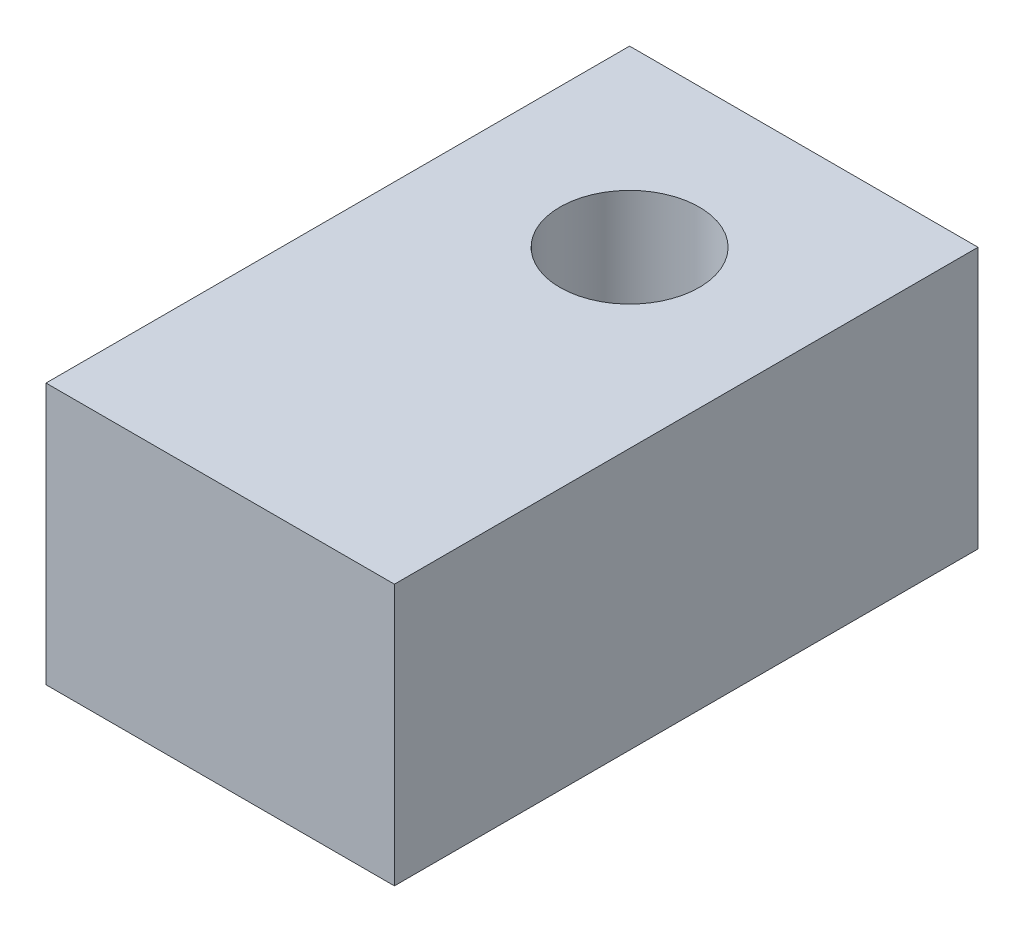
from build123d import *

# Parameters (mm, degrees)
CROQUIS1_W                         = 40
CROQUIS1_H                         = 30
EXTRUIR1_DEPTH                     = 67
TALADRO_DE_DI_METRO_DE_16_0_16_1_D = 16


with BuildPart() as part:
    # Croquis1 → Extruir1 (new body)
    with BuildSketch(Plane.XY):
        Rectangle(CROQUIS1_W, CROQUIS1_H)
    extrude(amount=EXTRUIR1_DEPTH)

    # Taladro de di_metro de _16.0 _16_1 (through all)
    with Locations(Plane(origin=(0, 15, 20), x_dir=(0, 0, 1), z_dir=(0, 1, 0))):
        with Locations((0, 0)):
            Hole(TALADRO_DE_DI_METRO_DE_16_0_16_1_D / 2)


solid = part.part
